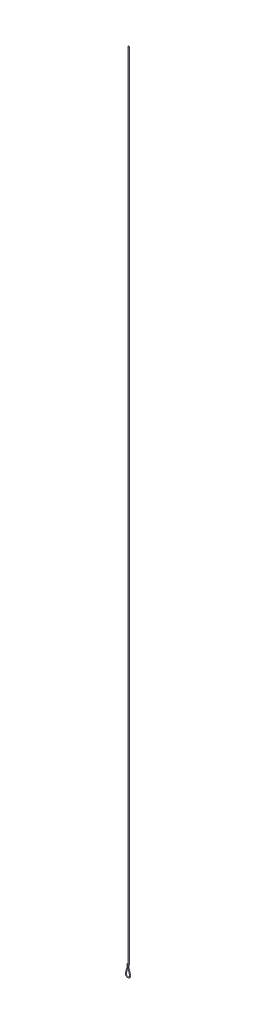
ISO-10303-21;
HEADER;
FILE_DESCRIPTION(('STEP AP214'),'2;1');
FILE_NAME('part.step','',(''),(''),'','','');
FILE_SCHEMA(('AUTOMOTIVE_DESIGN { 1 0 10303 214 1 1 1 1 }'));
ENDSEC;
DATA;
#1=APPLICATION_CONTEXT('core data for automotive mechanical design processes');
#2=APPLICATION_PROTOCOL_DEFINITION('international standard','automotive_design',2000,#1);
#3=PRODUCT_CONTEXT('',#1,'mechanical');
#4=PRODUCT('Part','Part','',(#3));
#5=PRODUCT_RELATED_PRODUCT_CATEGORY('part','',(#4));
#6=PRODUCT_DEFINITION_FORMATION('','',#4);
#7=PRODUCT_DEFINITION_CONTEXT('part definition',#1,'design');
#8=PRODUCT_DEFINITION('design','',#6,#7);
#9=PRODUCT_DEFINITION_SHAPE('','',#8);
#10=(LENGTH_UNIT() NAMED_UNIT(*) SI_UNIT(.MILLI.,.METRE.));
#11=(NAMED_UNIT(*) PLANE_ANGLE_UNIT() SI_UNIT($,.RADIAN.));
#12=(NAMED_UNIT(*) SI_UNIT($,.STERADIAN.) SOLID_ANGLE_UNIT());
#13=UNCERTAINTY_MEASURE_WITH_UNIT(LENGTH_MEASURE(1.E-05),#10,'distance_accuracy_value','');
#14=(GEOMETRIC_REPRESENTATION_CONTEXT(3) GLOBAL_UNCERTAINTY_ASSIGNED_CONTEXT((#13)) GLOBAL_UNIT_ASSIGNED_CONTEXT((#10,
#11,#12)) REPRESENTATION_CONTEXT('',''));
#15=CARTESIAN_POINT('',(0.,0.,0.));
#16=DIRECTION('',(0.,0.,1.));
#17=DIRECTION('',(1.,0.,0.));
#18=AXIS2_PLACEMENT_3D('',#15,#16,#17);
#19=CARTESIAN_POINT('',(4.38538112E-13,9.525,0.));
#20=DIRECTION('',(0.,1.,0.));
#21=DIRECTION('',(-1.,0.,0.));
#22=AXIS2_PLACEMENT_3D('',#19,#20,#21);
#23=CYLINDRICAL_SURFACE('',#22,1.203325);
#24=CARTESIAN_POINT('',(0.,2512.6238,0.));
#25=DIRECTION('',(0.,1.,0.));
#26=DIRECTION('',(-1.,0.,0.));
#27=AXIS2_PLACEMENT_3D('',#24,#25,#26);
#28=CIRCLE('',#27,1.203325);
#29=CARTESIAN_POINT('',(1.203325,2512.6238,0.));
#30=VERTEX_POINT('',#29);
#31=EDGE_CURVE('P0_E39',#30,#30,#28,.T.);
#32=ORIENTED_EDGE('',*,*,#31,.T.);
#33=EDGE_LOOP('',(#32));
#34=FACE_BOUND('',#33,.T.);
#35=CARTESIAN_POINT('',(4.38538112E-13,9.525,0.));
#36=DIRECTION('',(0.,1.,0.));
#37=DIRECTION('',(-1.,0.,0.));
#38=AXIS2_PLACEMENT_3D('',#35,#36,#37);
#39=CIRCLE('',#38,1.203325);
#40=CARTESIAN_POINT('',(1.20332500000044,9.525,0.));
#41=VERTEX_POINT('',#40);
#42=EDGE_CURVE('P0_E21',#41,#41,#39,.F.);
#43=ORIENTED_EDGE('',*,*,#42,.T.);
#44=EDGE_LOOP('',(#43));
#45=FACE_BOUND('',#44,.T.);
#46=ADVANCED_FACE('P0_F18',(#34,#45),#23,.F.);
#47=CARTESIAN_POINT('',(4.38538112E-13,9.525,0.));
#48=DIRECTION('',(0.,1.,0.));
#49=DIRECTION('',(0.,0.,1.));
#50=AXIS2_PLACEMENT_3D('',#47,#48,#49);
#51=PLANE('',#50);
#52=ORIENTED_EDGE('',*,*,#42,.F.);
#53=EDGE_LOOP('',(#52));
#54=FACE_BOUND('',#53,.T.);
#55=CARTESIAN_POINT('',(4.38538112E-13,9.525,0.));
#56=DIRECTION('',(0.,1.,0.));
#57=DIRECTION('',(-1.,0.,0.));
#58=AXIS2_PLACEMENT_3D('',#55,#56,#57);
#59=CIRCLE('',#58,1.5875);
#60=CARTESIAN_POINT('',(1.58750000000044,9.525,0.));
#61=VERTEX_POINT('',#60);
#62=EDGE_CURVE('P0_E26',#61,#61,#59,.T.);
#63=ORIENTED_EDGE('',*,*,#62,.F.);
#64=EDGE_LOOP('',(#63));
#65=FACE_BOUND('',#64,.T.);
#66=ADVANCED_FACE('P0_F60',(#54,#65),#51,.F.);
#67=CARTESIAN_POINT('',(0.,2512.6238,0.));
#68=DIRECTION('',(0.,-1.,0.));
#69=DIRECTION('',(0.,0.,-1.));
#70=AXIS2_PLACEMENT_3D('',#67,#68,#69);
#71=PLANE('',#70);
#72=ORIENTED_EDGE('',*,*,#31,.F.);
#73=EDGE_LOOP('',(#72));
#74=FACE_BOUND('',#73,.T.);
#75=CARTESIAN_POINT('',(0.,2512.6238,0.));
#76=DIRECTION('',(0.,1.,0.));
#77=DIRECTION('',(-1.,0.,0.));
#78=AXIS2_PLACEMENT_3D('',#75,#76,#77);
#79=CIRCLE('',#78,1.5875);
#80=CARTESIAN_POINT('',(1.5875,2512.6238,0.));
#81=VERTEX_POINT('',#80);
#82=EDGE_CURVE('P0_E10',#81,#81,#79,.F.);
#83=ORIENTED_EDGE('',*,*,#82,.F.);
#84=EDGE_LOOP('',(#83));
#85=FACE_BOUND('',#84,.T.);
#86=ADVANCED_FACE('P0_F46',(#74,#85),#71,.F.);
#87=CARTESIAN_POINT('',(4.38538112E-13,9.525,0.));
#88=DIRECTION('',(0.,1.,0.));
#89=DIRECTION('',(-1.,0.,0.));
#90=AXIS2_PLACEMENT_3D('',#87,#88,#89);
#91=CYLINDRICAL_SURFACE('',#90,1.5875);
#92=ORIENTED_EDGE('',*,*,#82,.T.);
#93=EDGE_LOOP('',(#92));
#94=FACE_BOUND('',#93,.T.);
#95=ORIENTED_EDGE('',*,*,#62,.T.);
#96=EDGE_LOOP('',(#95));
#97=FACE_BOUND('',#96,.T.);
#98=ADVANCED_FACE('P0_F48',(#94,#97),#91,.T.);
#99=CLOSED_SHELL('',(#46,#66,#86,#98));
#100=MANIFOLD_SOLID_BREP('P0_B1',#99);
#101=CARTESIAN_POINT('',(-3.505,9.525,0.));
#102=DIRECTION('',(0.,1.,0.));
#103=DIRECTION('',(0.,0.,1.));
#104=AXIS2_PLACEMENT_3D('',#101,#102,#103);
#105=PLANE('',#104);
#106=CARTESIAN_POINT('',(-3.505,9.525,0.));
#107=DIRECTION('',(0.,-1.,0.));
#108=DIRECTION('',(1.,0.,0.));
#109=AXIS2_PLACEMENT_3D('',#106,#107,#108);
#110=CIRCLE('',#109,1.190625);
#111=CARTESIAN_POINT('',(-2.314375,9.525,0.));
#112=VERTEX_POINT('',#111);
#113=EDGE_CURVE('P1_E19',#112,#112,#110,.T.);
#114=ORIENTED_EDGE('',*,*,#113,.F.);
#115=EDGE_LOOP('',(#114));
#116=FACE_BOUND('',#115,.T.);
#117=ADVANCED_FACE('P1_F16',(#116),#105,.T.);
#118=CARTESIAN_POINT('',(-3.505,9.525,0.));
#119=DIRECTION('',(0.,-1.,0.));
#120=DIRECTION('',(1.,0.,0.));
#121=AXIS2_PLACEMENT_3D('',#118,#119,#120);
#122=CYLINDRICAL_SURFACE('',#121,1.190625);
#123=CARTESIAN_POINT('',(-3.505,0.,0.));
#124=DIRECTION('',(-0.139369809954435,-0.990240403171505,0.));
#125=DIRECTION('',(-0.990240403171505,0.139369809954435,0.));
#126=AXIS2_PLACEMENT_3D('',#123,#124,#125);
#127=ELLIPSE('',#126,1.2023595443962,1.190625);
#128=CARTESIAN_POINT('',(-3.505,0.,-1.190625));
#129=VERTEX_POINT('',#128);
#130=CARTESIAN_POINT('',(-3.505,0.,1.190625));
#131=VERTEX_POINT('',#130);
#132=EDGE_CURVE('P1_E67',#129,#131,#127,.T.);
#133=ORIENTED_EDGE('',*,*,#132,.F.);
#134=CARTESIAN_POINT('',(-3.505,0.,0.));
#135=DIRECTION('',(-0.139369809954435,-0.990240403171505,0.));
#136=DIRECTION('',(-0.990240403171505,0.139369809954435,0.));
#137=AXIS2_PLACEMENT_3D('',#134,#135,#136);
#138=ELLIPSE('',#137,1.2023595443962,1.190625);
#139=EDGE_CURVE('P1_E63',#131,#129,#138,.T.);
#140=ORIENTED_EDGE('',*,*,#139,.F.);
#141=EDGE_LOOP('',(#133,#140));
#142=FACE_BOUND('',#141,.T.);
#143=ORIENTED_EDGE('',*,*,#113,.T.);
#144=EDGE_LOOP('',(#143));
#145=FACE_BOUND('',#144,.T.);
#146=ADVANCED_FACE('P1_F65',(#142,#145),#122,.T.);
#147=CARTESIAN_POINT('',(-3.505,0.,0.));
#148=DIRECTION('',(-0.276019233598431,-0.96115211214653,0.));
#149=DIRECTION('',(0.96115211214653,-0.276019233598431,0.));
#150=AXIS2_PLACEMENT_3D('',#147,#148,#149);
#151=CYLINDRICAL_SURFACE('',#150,1.190625);
#152=ORIENTED_EDGE('',*,*,#132,.T.);
#153=ORIENTED_EDGE('',*,*,#139,.T.);
#154=EDGE_LOOP('',(#152,#153));
#155=FACE_BOUND('',#154,.T.);
#156=CARTESIAN_POINT('',(-8.30217656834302,-16.7046923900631,0.));
#157=DIRECTION('',(-0.276019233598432,-0.961152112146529,0.));
#158=DIRECTION('',(-0.961152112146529,0.276019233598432,0.));
#159=AXIS2_PLACEMENT_3D('',#156,#157,#158);
#160=CIRCLE('',#159,1.190625);
#161=CARTESIAN_POINT('',(-7.15780483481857,-17.0333277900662,0.));
#162=VERTEX_POINT('',#161);
#163=EDGE_CURVE('P1_E41',#162,#162,#160,.T.);
#164=ORIENTED_EDGE('',*,*,#163,.F.);
#165=EDGE_LOOP('',(#164));
#166=FACE_BOUND('',#165,.T.);
#167=ADVANCED_FACE('P1_F71',(#155,#166),#151,.T.);
#168=CARTESIAN_POINT('',(-1.7525,-18.5855983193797,0.));
#169=DIRECTION('',(0.,0.,1.));
#170=DIRECTION('',(1.,0.,0.));
#171=AXIS2_PLACEMENT_3D('',#168,#169,#170);
#172=TOROIDAL_SURFACE('',#171,6.81440168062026,1.190625);
#173=ORIENTED_EDGE('',*,*,#163,.T.);
#174=EDGE_LOOP('',(#173));
#175=FACE_BOUND('',#174,.T.);
#176=CARTESIAN_POINT('',(4.79717656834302,-16.7046923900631,0.));
#177=DIRECTION('',(-0.276019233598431,0.96115211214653,0.));
#178=DIRECTION('',(-0.96115211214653,-0.276019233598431,0.));
#179=AXIS2_PLACEMENT_3D('',#176,#177,#178);
#180=CIRCLE('',#179,1.190625);
#181=CARTESIAN_POINT('',(3.65280483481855,-17.0333277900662,0.));
#182=VERTEX_POINT('',#181);
#183=EDGE_CURVE('P1_E80',#182,#182,#180,.T.);
#184=ORIENTED_EDGE('',*,*,#183,.F.);
#185=EDGE_LOOP('',(#184));
#186=FACE_BOUND('',#185,.T.);
#187=ADVANCED_FACE('P1_F92',(#175,#186),#172,.T.);
#188=CARTESIAN_POINT('',(0.,2512.6238,0.));
#189=DIRECTION('',(0.,-1.,0.));
#190=DIRECTION('',(0.,0.,-1.));
#191=AXIS2_PLACEMENT_3D('',#188,#189,#190);
#192=PLANE('',#191);
#193=CARTESIAN_POINT('',(0.,2512.6238,0.));
#194=DIRECTION('',(0.,1.,0.));
#195=DIRECTION('',(-1.,0.,0.));
#196=AXIS2_PLACEMENT_3D('',#193,#194,#195);
#197=CIRCLE('',#196,1.190625);
#198=CARTESIAN_POINT('',(-1.190625,2512.6238,0.));
#199=VERTEX_POINT('',#198);
#200=EDGE_CURVE('P1_E77',#199,#199,#197,.F.);
#201=ORIENTED_EDGE('',*,*,#200,.F.);
#202=EDGE_LOOP('',(#201));
#203=FACE_BOUND('',#202,.T.);
#204=ADVANCED_FACE('P1_F96',(#203),#192,.F.);
#205=CARTESIAN_POINT('',(4.79717656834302,-16.7046923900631,0.));
#206=DIRECTION('',(-0.276019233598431,0.96115211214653,0.));
#207=DIRECTION('',(-0.96115211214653,-0.276019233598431,0.));
#208=AXIS2_PLACEMENT_3D('',#205,#206,#207);
#209=CYLINDRICAL_SURFACE('',#208,1.190625);
#210=CARTESIAN_POINT('',(0.,0.,0.));
#211=DIRECTION('',(-0.139369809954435,0.990240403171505,0.));
#212=DIRECTION('',(0.990240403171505,0.139369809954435,0.));
#213=AXIS2_PLACEMENT_3D('',#210,#211,#212);
#214=ELLIPSE('',#213,1.2023595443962,1.190625);
#215=CARTESIAN_POINT('',(0.,0.,-1.190625));
#216=VERTEX_POINT('',#215);
#217=CARTESIAN_POINT('',(0.,0.,1.190625));
#218=VERTEX_POINT('',#217);
#219=EDGE_CURVE('P1_E25',#216,#218,#214,.T.);
#220=ORIENTED_EDGE('',*,*,#219,.F.);
#221=CARTESIAN_POINT('',(0.,0.,0.));
#222=DIRECTION('',(-0.139369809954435,0.990240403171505,0.));
#223=DIRECTION('',(0.990240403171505,0.139369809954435,0.));
#224=AXIS2_PLACEMENT_3D('',#221,#222,#223);
#225=ELLIPSE('',#224,1.2023595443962,1.190625);
#226=EDGE_CURVE('P1_E11',#218,#216,#225,.T.);
#227=ORIENTED_EDGE('',*,*,#226,.F.);
#228=EDGE_LOOP('',(#220,#227));
#229=FACE_BOUND('',#228,.T.);
#230=ORIENTED_EDGE('',*,*,#183,.T.);
#231=EDGE_LOOP('',(#230));
#232=FACE_BOUND('',#231,.T.);
#233=ADVANCED_FACE('P1_F106',(#229,#232),#209,.T.);
#234=CARTESIAN_POINT('',(0.,0.,0.));
#235=DIRECTION('',(0.,1.,0.));
#236=DIRECTION('',(-1.,0.,0.));
#237=AXIS2_PLACEMENT_3D('',#234,#235,#236);
#238=CYLINDRICAL_SURFACE('',#237,1.190625);
#239=ORIENTED_EDGE('',*,*,#219,.T.);
#240=ORIENTED_EDGE('',*,*,#226,.T.);
#241=EDGE_LOOP('',(#239,#240));
#242=FACE_BOUND('',#241,.T.);
#243=ORIENTED_EDGE('',*,*,#200,.T.);
#244=EDGE_LOOP('',(#243));
#245=FACE_BOUND('',#244,.T.);
#246=ADVANCED_FACE('P1_F105',(#242,#245),#238,.T.);
#247=CLOSED_SHELL('',(#117,#146,#167,#187,#204,#233,#246));
#248=MANIFOLD_SOLID_BREP('P1_B1',#247);
#249=ADVANCED_BREP_SHAPE_REPRESENTATION('',(#18,#100,#248),#14);
#250=SHAPE_DEFINITION_REPRESENTATION(#9,#249);
ENDSEC;
END-ISO-10303-21;
